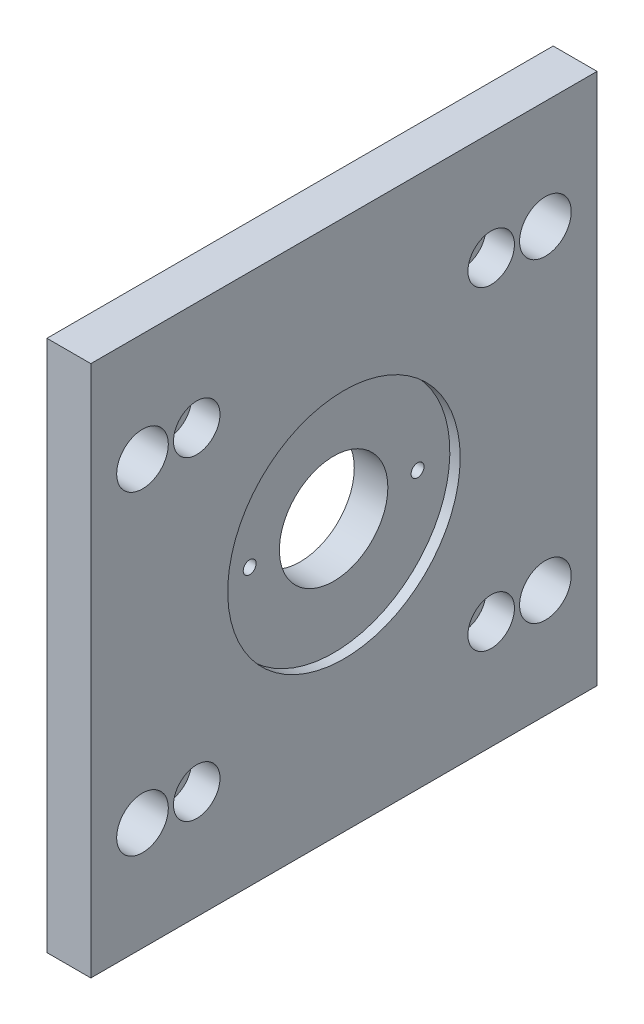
ISO-10303-21;
HEADER;
FILE_DESCRIPTION(('STEP AP214'),'2;1');
FILE_NAME('part.step','',(''),(''),'','','');
FILE_SCHEMA(('AUTOMOTIVE_DESIGN { 1 0 10303 214 1 1 1 1 }'));
ENDSEC;
DATA;
#1=APPLICATION_CONTEXT('core data for automotive mechanical design processes');
#2=APPLICATION_PROTOCOL_DEFINITION('international standard','automotive_design',2000,#1);
#3=PRODUCT_CONTEXT('',#1,'mechanical');
#4=PRODUCT('Part','Part','',(#3));
#5=PRODUCT_RELATED_PRODUCT_CATEGORY('part','',(#4));
#6=PRODUCT_DEFINITION_FORMATION('','',#4);
#7=PRODUCT_DEFINITION_CONTEXT('part definition',#1,'design');
#8=PRODUCT_DEFINITION('design','',#6,#7);
#9=PRODUCT_DEFINITION_SHAPE('','',#8);
#10=(LENGTH_UNIT() NAMED_UNIT(*) SI_UNIT(.MILLI.,.METRE.));
#11=(NAMED_UNIT(*) PLANE_ANGLE_UNIT() SI_UNIT($,.RADIAN.));
#12=(NAMED_UNIT(*) SI_UNIT($,.STERADIAN.) SOLID_ANGLE_UNIT());
#13=UNCERTAINTY_MEASURE_WITH_UNIT(LENGTH_MEASURE(1.E-05),#10,'distance_accuracy_value','');
#14=(GEOMETRIC_REPRESENTATION_CONTEXT(3) GLOBAL_UNCERTAINTY_ASSIGNED_CONTEXT((#13)) GLOBAL_UNIT_ASSIGNED_CONTEXT((#10,
#11,#12)) REPRESENTATION_CONTEXT('',''));
#15=CARTESIAN_POINT('',(0.,0.,0.));
#16=DIRECTION('',(0.,0.,1.));
#17=DIRECTION('',(1.,0.,0.));
#18=AXIS2_PLACEMENT_3D('',#15,#16,#17);
#19=CARTESIAN_POINT('',(-17.,78.0000000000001,98.0000000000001));
#20=DIRECTION('',(-1.,0.,0.));
#21=DIRECTION('',(0.,0.,1.));
#22=AXIS2_PLACEMENT_3D('',#19,#20,#21);
#23=PLANE('',#22);
#24=CARTESIAN_POINT('',(-17.,78.0000000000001,65.5000000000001));
#25=DIRECTION('',(1.,0.,0.));
#26=DIRECTION('',(0.,0.,-1.));
#27=AXIS2_PLACEMENT_3D('',#24,#25,#26);
#28=CIRCLE('',#27,2.5);
#29=CARTESIAN_POINT('',(-17.,78.0000000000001,63.0000000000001));
#30=VERTEX_POINT('',#29);
#31=EDGE_CURVE('E109',#30,#30,#28,.T.);
#32=ORIENTED_EDGE('',*,*,#31,.T.);
#33=EDGE_LOOP('',(#32));
#34=FACE_BOUND('',#33,.T.);
#35=CARTESIAN_POINT('',(-17.,78.0000000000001,98.0000000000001));
#36=DIRECTION('',(-1.,0.,0.));
#37=DIRECTION('',(0.,0.,1.));
#38=AXIS2_PLACEMENT_3D('',#35,#36,#37);
#39=CIRCLE('',#38,21.);
#40=CARTESIAN_POINT('',(-17.,78.0000000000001,119.));
#41=VERTEX_POINT('',#40);
#42=EDGE_CURVE('E118',#41,#41,#39,.T.);
#43=ORIENTED_EDGE('',*,*,#42,.F.);
#44=EDGE_LOOP('',(#43));
#45=FACE_BOUND('',#44,.T.);
#46=CARTESIAN_POINT('',(-17.,139.,155.));
#47=DIRECTION('',(-1.,0.,0.));
#48=DIRECTION('',(0.,0.,1.));
#49=AXIS2_PLACEMENT_3D('',#46,#47,#48);
#50=CIRCLE('',#49,5.5);
#51=CARTESIAN_POINT('',(-17.,139.,160.5));
#52=VERTEX_POINT('',#51);
#53=EDGE_CURVE('E33',#52,#52,#50,.T.);
#54=ORIENTED_EDGE('',*,*,#53,.F.);
#55=EDGE_LOOP('',(#54));
#56=FACE_BOUND('',#55,.T.);
#57=CARTESIAN_POINT('',(-17.,139.,41.));
#58=DIRECTION('',(-1.,0.,0.));
#59=DIRECTION('',(0.,0.,1.));
#60=AXIS2_PLACEMENT_3D('',#57,#58,#59);
#61=CIRCLE('',#60,5.5);
#62=CARTESIAN_POINT('',(-17.,139.,46.5));
#63=VERTEX_POINT('',#62);
#64=EDGE_CURVE('E142',#63,#63,#61,.T.);
#65=ORIENTED_EDGE('',*,*,#64,.F.);
#66=EDGE_LOOP('',(#65));
#67=FACE_BOUND('',#66,.T.);
#68=CARTESIAN_POINT('',(-17.,17.,155.));
#69=DIRECTION('',(-1.,0.,0.));
#70=DIRECTION('',(0.,0.,1.));
#71=AXIS2_PLACEMENT_3D('',#68,#69,#70);
#72=CIRCLE('',#71,5.5);
#73=CARTESIAN_POINT('',(-17.,17.,160.5));
#74=VERTEX_POINT('',#73);
#75=EDGE_CURVE('E150',#74,#74,#72,.T.);
#76=ORIENTED_EDGE('',*,*,#75,.F.);
#77=EDGE_LOOP('',(#76));
#78=FACE_BOUND('',#77,.T.);
#79=CARTESIAN_POINT('',(-17.,17.,41.));
#80=DIRECTION('',(-1.,0.,0.));
#81=DIRECTION('',(0.,0.,1.));
#82=AXIS2_PLACEMENT_3D('',#79,#80,#81);
#83=CIRCLE('',#82,5.5);
#84=CARTESIAN_POINT('',(-17.,17.,46.5));
#85=VERTEX_POINT('',#84);
#86=EDGE_CURVE('E182',#85,#85,#83,.T.);
#87=ORIENTED_EDGE('',*,*,#86,.F.);
#88=EDGE_LOOP('',(#87));
#89=FACE_BOUND('',#88,.T.);
#90=CARTESIAN_POINT('',(-17.,139.,176.));
#91=DIRECTION('',(-1.,0.,0.));
#92=DIRECTION('',(0.,0.,1.));
#93=AXIS2_PLACEMENT_3D('',#90,#91,#92);
#94=CIRCLE('',#93,10.);
#95=CARTESIAN_POINT('',(-17.,139.,186.));
#96=VERTEX_POINT('',#95);
#97=EDGE_CURVE('E151',#96,#96,#94,.T.);
#98=ORIENTED_EDGE('',*,*,#97,.F.);
#99=EDGE_LOOP('',(#98));
#100=FACE_BOUND('',#99,.T.);
#101=CARTESIAN_POINT('',(-17.,139.,20.));
#102=DIRECTION('',(-1.,0.,0.));
#103=DIRECTION('',(0.,0.,1.));
#104=AXIS2_PLACEMENT_3D('',#101,#102,#103);
#105=CIRCLE('',#104,10.);
#106=CARTESIAN_POINT('',(-17.,139.,30.));
#107=VERTEX_POINT('',#106);
#108=EDGE_CURVE('E156',#107,#107,#105,.T.);
#109=ORIENTED_EDGE('',*,*,#108,.F.);
#110=EDGE_LOOP('',(#109));
#111=FACE_BOUND('',#110,.T.);
#112=CARTESIAN_POINT('',(-17.,17.,176.));
#113=DIRECTION('',(-1.,0.,0.));
#114=DIRECTION('',(0.,0.,1.));
#115=AXIS2_PLACEMENT_3D('',#112,#113,#114);
#116=CIRCLE('',#115,10.);
#117=CARTESIAN_POINT('',(-17.,17.,186.));
#118=VERTEX_POINT('',#117);
#119=EDGE_CURVE('E160',#118,#118,#116,.T.);
#120=ORIENTED_EDGE('',*,*,#119,.F.);
#121=EDGE_LOOP('',(#120));
#122=FACE_BOUND('',#121,.T.);
#123=CARTESIAN_POINT('',(-17.,17.,20.));
#124=DIRECTION('',(-1.,0.,0.));
#125=DIRECTION('',(0.,0.,1.));
#126=AXIS2_PLACEMENT_3D('',#123,#124,#125);
#127=CIRCLE('',#126,10.);
#128=CARTESIAN_POINT('',(-17.,17.,30.));
#129=VERTEX_POINT('',#128);
#130=EDGE_CURVE('E164',#129,#129,#127,.T.);
#131=ORIENTED_EDGE('',*,*,#130,.F.);
#132=EDGE_LOOP('',(#131));
#133=FACE_BOUND('',#132,.T.);
#134=DIRECTION('',(0.,1.,0.));
#135=VECTOR('',#134,1.);
#136=CARTESIAN_POINT('',(-17.,78.0000000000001,0.));
#137=LINE('',#136,#135);
#138=CARTESIAN_POINT('',(-17.,-25.,0.));
#139=VERTEX_POINT('',#138);
#140=CARTESIAN_POINT('',(-17.,181.,0.));
#141=VERTEX_POINT('',#140);
#142=EDGE_CURVE('E11',#139,#141,#137,.T.);
#143=ORIENTED_EDGE('',*,*,#142,.F.);
#144=DIRECTION('',(0.,0.,-1.));
#145=VECTOR('',#144,1.);
#146=CARTESIAN_POINT('',(-17.,-25.,196.));
#147=LINE('',#146,#145);
#148=CARTESIAN_POINT('',(-17.,-25.,196.));
#149=VERTEX_POINT('',#148);
#150=EDGE_CURVE('E99',#149,#139,#147,.T.);
#151=ORIENTED_EDGE('',*,*,#150,.F.);
#152=DIRECTION('',(0.,-1.,0.));
#153=VECTOR('',#152,1.);
#154=CARTESIAN_POINT('',(-17.,78.0000000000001,196.));
#155=LINE('',#154,#153);
#156=CARTESIAN_POINT('',(-17.,181.,196.));
#157=VERTEX_POINT('',#156);
#158=EDGE_CURVE('E38',#157,#149,#155,.T.);
#159=ORIENTED_EDGE('',*,*,#158,.F.);
#160=DIRECTION('',(0.,0.,1.));
#161=VECTOR('',#160,1.);
#162=CARTESIAN_POINT('',(-17.,181.,0.));
#163=LINE('',#162,#161);
#164=EDGE_CURVE('E85',#141,#157,#163,.T.);
#165=ORIENTED_EDGE('',*,*,#164,.F.);
#166=EDGE_LOOP('',(#143,#151,#159,#165));
#167=FACE_BOUND('',#166,.T.);
#168=CARTESIAN_POINT('',(-17.,78.0000000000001,130.5));
#169=DIRECTION('',(1.,0.,0.));
#170=DIRECTION('',(0.,0.,-1.));
#171=AXIS2_PLACEMENT_3D('',#168,#169,#170);
#172=CIRCLE('',#171,2.5);
#173=CARTESIAN_POINT('',(-17.,78.0000000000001,128.));
#174=VERTEX_POINT('',#173);
#175=EDGE_CURVE('E103',#174,#174,#172,.T.);
#176=ORIENTED_EDGE('',*,*,#175,.T.);
#177=EDGE_LOOP('',(#176));
#178=FACE_BOUND('',#177,.T.);
#179=ADVANCED_FACE('F30',(#34,#45,#56,#67,#78,#89,#100,#111,#122,#133,#167,#178),#23,.T.);
#180=CARTESIAN_POINT('',(0.,78.0000000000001,0.));
#181=DIRECTION('',(0.,0.,-1.));
#182=DIRECTION('',(-1.,0.,0.));
#183=AXIS2_PLACEMENT_3D('',#180,#181,#182);
#184=PLANE('',#183);
#185=DIRECTION('',(0.,-1.,0.));
#186=VECTOR('',#185,1.);
#187=CARTESIAN_POINT('',(0.,78.0000000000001,0.));
#188=LINE('',#187,#186);
#189=CARTESIAN_POINT('',(0.,181.,0.));
#190=VERTEX_POINT('',#189);
#191=CARTESIAN_POINT('',(0.,-25.,0.));
#192=VERTEX_POINT('',#191);
#193=EDGE_CURVE('E46',#190,#192,#188,.T.);
#194=ORIENTED_EDGE('',*,*,#193,.T.);
#195=DIRECTION('',(1.,0.,0.));
#196=VECTOR('',#195,1.);
#197=CARTESIAN_POINT('',(-17.,-25.,0.));
#198=LINE('',#197,#196);
#199=EDGE_CURVE('E101',#139,#192,#198,.T.);
#200=ORIENTED_EDGE('',*,*,#199,.F.);
#201=ORIENTED_EDGE('',*,*,#142,.T.);
#202=DIRECTION('',(-1.,0.,0.));
#203=VECTOR('',#202,1.);
#204=CARTESIAN_POINT('',(0.,181.,0.));
#205=LINE('',#204,#203);
#206=EDGE_CURVE('E81',#190,#141,#205,.T.);
#207=ORIENTED_EDGE('',*,*,#206,.F.);
#208=EDGE_LOOP('',(#194,#200,#201,#207));
#209=FACE_BOUND('',#208,.T.);
#210=ADVANCED_FACE('F82',(#209),#184,.T.);
#211=CARTESIAN_POINT('',(0.,78.0000000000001,98.0000000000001));
#212=DIRECTION('',(1.,0.,0.));
#213=DIRECTION('',(0.,0.,-1.));
#214=AXIS2_PLACEMENT_3D('',#211,#212,#213);
#215=PLANE('',#214);
#216=CARTESIAN_POINT('',(0.,139.,155.));
#217=DIRECTION('',(1.,0.,0.));
#218=DIRECTION('',(0.,0.,-1.));
#219=AXIS2_PLACEMENT_3D('',#216,#217,#218);
#220=CIRCLE('',#219,9.);
#221=CARTESIAN_POINT('',(0.,139.,146.));
#222=VERTEX_POINT('',#221);
#223=EDGE_CURVE('E125',#222,#222,#220,.T.);
#224=ORIENTED_EDGE('',*,*,#223,.F.);
#225=EDGE_LOOP('',(#224));
#226=FACE_BOUND('',#225,.T.);
#227=CARTESIAN_POINT('',(0.,139.,41.));
#228=DIRECTION('',(1.,0.,0.));
#229=DIRECTION('',(0.,0.,-1.));
#230=AXIS2_PLACEMENT_3D('',#227,#228,#229);
#231=CIRCLE('',#230,9.);
#232=CARTESIAN_POINT('',(0.,139.,32.));
#233=VERTEX_POINT('',#232);
#234=EDGE_CURVE('E131',#233,#233,#231,.T.);
#235=ORIENTED_EDGE('',*,*,#234,.F.);
#236=EDGE_LOOP('',(#235));
#237=FACE_BOUND('',#236,.T.);
#238=CARTESIAN_POINT('',(0.,17.,155.));
#239=DIRECTION('',(1.,0.,0.));
#240=DIRECTION('',(0.,0.,-1.));
#241=AXIS2_PLACEMENT_3D('',#238,#239,#240);
#242=CIRCLE('',#241,9.);
#243=CARTESIAN_POINT('',(0.,17.,146.));
#244=VERTEX_POINT('',#243);
#245=EDGE_CURVE('E138',#244,#244,#242,.T.);
#246=ORIENTED_EDGE('',*,*,#245,.F.);
#247=EDGE_LOOP('',(#246));
#248=FACE_BOUND('',#247,.T.);
#249=CARTESIAN_POINT('',(0.,17.,41.));
#250=DIRECTION('',(1.,0.,0.));
#251=DIRECTION('',(0.,0.,-1.));
#252=AXIS2_PLACEMENT_3D('',#249,#250,#251);
#253=CIRCLE('',#252,9.);
#254=CARTESIAN_POINT('',(0.,17.,32.));
#255=VERTEX_POINT('',#254);
#256=EDGE_CURVE('E146',#255,#255,#253,.T.);
#257=ORIENTED_EDGE('',*,*,#256,.F.);
#258=EDGE_LOOP('',(#257));
#259=FACE_BOUND('',#258,.T.);
#260=CARTESIAN_POINT('',(0.,139.,176.));
#261=DIRECTION('',(1.,0.,0.));
#262=DIRECTION('',(0.,0.,-1.));
#263=AXIS2_PLACEMENT_3D('',#260,#261,#262);
#264=CIRCLE('',#263,10.);
#265=CARTESIAN_POINT('',(0.,139.,166.));
#266=VERTEX_POINT('',#265);
#267=EDGE_CURVE('E155',#266,#266,#264,.T.);
#268=ORIENTED_EDGE('',*,*,#267,.F.);
#269=EDGE_LOOP('',(#268));
#270=FACE_BOUND('',#269,.T.);
#271=CARTESIAN_POINT('',(0.,139.,20.));
#272=DIRECTION('',(1.,0.,0.));
#273=DIRECTION('',(0.,0.,-1.));
#274=AXIS2_PLACEMENT_3D('',#271,#272,#273);
#275=CIRCLE('',#274,10.);
#276=CARTESIAN_POINT('',(0.,139.,10.));
#277=VERTEX_POINT('',#276);
#278=EDGE_CURVE('E154',#277,#277,#275,.T.);
#279=ORIENTED_EDGE('',*,*,#278,.F.);
#280=EDGE_LOOP('',(#279));
#281=FACE_BOUND('',#280,.T.);
#282=CARTESIAN_POINT('',(0.,17.,176.));
#283=DIRECTION('',(1.,0.,0.));
#284=DIRECTION('',(0.,0.,-1.));
#285=AXIS2_PLACEMENT_3D('',#282,#283,#284);
#286=CIRCLE('',#285,10.);
#287=CARTESIAN_POINT('',(0.,17.,166.));
#288=VERTEX_POINT('',#287);
#289=EDGE_CURVE('E159',#288,#288,#286,.T.);
#290=ORIENTED_EDGE('',*,*,#289,.F.);
#291=EDGE_LOOP('',(#290));
#292=FACE_BOUND('',#291,.T.);
#293=CARTESIAN_POINT('',(0.,17.,20.));
#294=DIRECTION('',(1.,0.,0.));
#295=DIRECTION('',(0.,0.,-1.));
#296=AXIS2_PLACEMENT_3D('',#293,#294,#295);
#297=CIRCLE('',#296,10.);
#298=CARTESIAN_POINT('',(0.,17.,9.99999999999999));
#299=VERTEX_POINT('',#298);
#300=EDGE_CURVE('E163',#299,#299,#297,.T.);
#301=ORIENTED_EDGE('',*,*,#300,.F.);
#302=EDGE_LOOP('',(#301));
#303=FACE_BOUND('',#302,.T.);
#304=CARTESIAN_POINT('',(0.,78.0000000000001,98.0000000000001));
#305=DIRECTION('',(1.,0.,0.));
#306=DIRECTION('',(0.,0.,-1.));
#307=AXIS2_PLACEMENT_3D('',#304,#305,#306);
#308=CIRCLE('',#307,45.);
#309=CARTESIAN_POINT('',(0.,78.0000000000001,53.0000000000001));
#310=VERTEX_POINT('',#309);
#311=EDGE_CURVE('E78',#310,#310,#308,.T.);
#312=ORIENTED_EDGE('',*,*,#311,.F.);
#313=EDGE_LOOP('',(#312));
#314=FACE_BOUND('',#313,.T.);
#315=DIRECTION('',(0.,1.,0.));
#316=VECTOR('',#315,1.);
#317=CARTESIAN_POINT('',(0.,78.0000000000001,196.));
#318=LINE('',#317,#316);
#319=CARTESIAN_POINT('',(0.,-25.,196.));
#320=VERTEX_POINT('',#319);
#321=CARTESIAN_POINT('',(0.,181.,196.));
#322=VERTEX_POINT('',#321);
#323=EDGE_CURVE('E77',#320,#322,#318,.T.);
#324=ORIENTED_EDGE('',*,*,#323,.F.);
#325=DIRECTION('',(0.,0.,1.));
#326=VECTOR('',#325,1.);
#327=CARTESIAN_POINT('',(0.,-25.,0.));
#328=LINE('',#327,#326);
#329=EDGE_CURVE('E76',#192,#320,#328,.T.);
#330=ORIENTED_EDGE('',*,*,#329,.F.);
#331=ORIENTED_EDGE('',*,*,#193,.F.);
#332=DIRECTION('',(0.,0.,-1.));
#333=VECTOR('',#332,1.);
#334=CARTESIAN_POINT('',(0.,181.,196.));
#335=LINE('',#334,#333);
#336=EDGE_CURVE('E74',#322,#190,#335,.T.);
#337=ORIENTED_EDGE('',*,*,#336,.F.);
#338=EDGE_LOOP('',(#324,#330,#331,#337));
#339=FACE_BOUND('',#338,.T.);
#340=ADVANCED_FACE('F72',(#226,#237,#248,#259,#270,#281,#292,#303,#314,#339),#215,.T.);
#341=CARTESIAN_POINT('',(0.,78.0000000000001,196.));
#342=DIRECTION('',(0.,0.,1.));
#343=DIRECTION('',(1.,0.,0.));
#344=AXIS2_PLACEMENT_3D('',#341,#342,#343);
#345=PLANE('',#344);
#346=ORIENTED_EDGE('',*,*,#323,.T.);
#347=DIRECTION('',(1.,0.,0.));
#348=VECTOR('',#347,1.);
#349=CARTESIAN_POINT('',(-17.,181.,196.));
#350=LINE('',#349,#348);
#351=EDGE_CURVE('E90',#157,#322,#350,.T.);
#352=ORIENTED_EDGE('',*,*,#351,.F.);
#353=ORIENTED_EDGE('',*,*,#158,.T.);
#354=DIRECTION('',(-1.,0.,0.));
#355=VECTOR('',#354,1.);
#356=CARTESIAN_POINT('',(0.,-25.,196.));
#357=LINE('',#356,#355);
#358=EDGE_CURVE('E96',#320,#149,#357,.T.);
#359=ORIENTED_EDGE('',*,*,#358,.F.);
#360=EDGE_LOOP('',(#346,#352,#353,#359));
#361=FACE_BOUND('',#360,.T.);
#362=ADVANCED_FACE('F234',(#361),#345,.T.);
#363=CARTESIAN_POINT('',(-4.,78.0000000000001,98.0000000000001));
#364=DIRECTION('',(-1.,0.,0.));
#365=DIRECTION('',(0.,0.,1.));
#366=AXIS2_PLACEMENT_3D('',#363,#364,#365);
#367=PLANE('',#366);
#368=CARTESIAN_POINT('',(-4.,78.0000000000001,130.5));
#369=DIRECTION('',(1.,0.,0.));
#370=DIRECTION('',(0.,0.,-1.));
#371=AXIS2_PLACEMENT_3D('',#368,#369,#370);
#372=CIRCLE('',#371,2.49999999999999);
#373=CARTESIAN_POINT('',(-4.,78.0000000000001,128.));
#374=VERTEX_POINT('',#373);
#375=EDGE_CURVE('E106',#374,#374,#372,.T.);
#376=ORIENTED_EDGE('',*,*,#375,.F.);
#377=EDGE_LOOP('',(#376));
#378=FACE_BOUND('',#377,.T.);
#379=CARTESIAN_POINT('',(-3.99999999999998,78.0000000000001,65.5000000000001));
#380=DIRECTION('',(1.,0.,0.));
#381=DIRECTION('',(0.,0.,-1.));
#382=AXIS2_PLACEMENT_3D('',#379,#380,#381);
#383=CIRCLE('',#382,2.49999999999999);
#384=CARTESIAN_POINT('',(-3.99999999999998,78.0000000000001,63.0000000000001));
#385=VERTEX_POINT('',#384);
#386=EDGE_CURVE('E112',#385,#385,#383,.T.);
#387=ORIENTED_EDGE('',*,*,#386,.F.);
#388=EDGE_LOOP('',(#387));
#389=FACE_BOUND('',#388,.T.);
#390=CARTESIAN_POINT('',(-4.,78.0000000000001,98.0000000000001));
#391=DIRECTION('',(1.,0.,0.));
#392=DIRECTION('',(0.,0.,-1.));
#393=AXIS2_PLACEMENT_3D('',#390,#391,#392);
#394=CIRCLE('',#393,21.);
#395=CARTESIAN_POINT('',(-4.,78.0000000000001,77.0000000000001));
#396=VERTEX_POINT('',#395);
#397=EDGE_CURVE('E115',#396,#396,#394,.T.);
#398=ORIENTED_EDGE('',*,*,#397,.F.);
#399=EDGE_LOOP('',(#398));
#400=FACE_BOUND('',#399,.T.);
#401=CARTESIAN_POINT('',(-4.,78.0000000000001,98.0000000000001));
#402=DIRECTION('',(1.,0.,0.));
#403=DIRECTION('',(0.,1.,0.));
#404=AXIS2_PLACEMENT_3D('',#401,#402,#403);
#405=CIRCLE('',#404,45.);
#406=CARTESIAN_POINT('',(-4.,123.,98.0000000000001));
#407=VERTEX_POINT('',#406);
#408=EDGE_CURVE('E167',#407,#407,#405,.T.);
#409=ORIENTED_EDGE('',*,*,#408,.T.);
#410=EDGE_LOOP('',(#409));
#411=FACE_BOUND('',#410,.T.);
#412=ADVANCED_FACE('F230',(#378,#389,#400,#411),#367,.F.);
#413=CARTESIAN_POINT('',(1.,78.0000000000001,98.0000000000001));
#414=DIRECTION('',(-1.,0.,0.));
#415=DIRECTION('',(0.,1.,0.));
#416=AXIS2_PLACEMENT_3D('',#413,#414,#415);
#417=CYLINDRICAL_SURFACE('',#416,45.);
#418=ORIENTED_EDGE('',*,*,#311,.T.);
#419=EDGE_LOOP('',(#418));
#420=FACE_BOUND('',#419,.T.);
#421=ORIENTED_EDGE('',*,*,#408,.F.);
#422=EDGE_LOOP('',(#421));
#423=FACE_BOUND('',#422,.T.);
#424=ADVANCED_FACE('F233',(#420,#423),#417,.F.);
#425=CARTESIAN_POINT('',(3.00000000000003,17.,20.));
#426=DIRECTION('',(-1.,0.,0.));
#427=DIRECTION('',(0.,1.,0.));
#428=AXIS2_PLACEMENT_3D('',#425,#426,#427);
#429=CYLINDRICAL_SURFACE('',#428,10.);
#430=ORIENTED_EDGE('',*,*,#130,.T.);
#431=EDGE_LOOP('',(#430));
#432=FACE_BOUND('',#431,.T.);
#433=ORIENTED_EDGE('',*,*,#300,.T.);
#434=EDGE_LOOP('',(#433));
#435=FACE_BOUND('',#434,.T.);
#436=ADVANCED_FACE('F243',(#432,#435),#429,.F.);
#437=CARTESIAN_POINT('',(3.00000000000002,17.,176.));
#438=DIRECTION('',(-1.,0.,0.));
#439=DIRECTION('',(0.,1.,0.));
#440=AXIS2_PLACEMENT_3D('',#437,#438,#439);
#441=CYLINDRICAL_SURFACE('',#440,10.);
#442=ORIENTED_EDGE('',*,*,#119,.T.);
#443=EDGE_LOOP('',(#442));
#444=FACE_BOUND('',#443,.T.);
#445=ORIENTED_EDGE('',*,*,#289,.T.);
#446=EDGE_LOOP('',(#445));
#447=FACE_BOUND('',#446,.T.);
#448=ADVANCED_FACE('F249',(#444,#447),#441,.F.);
#449=CARTESIAN_POINT('',(3.,139.,20.));
#450=DIRECTION('',(-1.,0.,0.));
#451=DIRECTION('',(0.,1.,0.));
#452=AXIS2_PLACEMENT_3D('',#449,#450,#451);
#453=CYLINDRICAL_SURFACE('',#452,10.);
#454=ORIENTED_EDGE('',*,*,#108,.T.);
#455=EDGE_LOOP('',(#454));
#456=FACE_BOUND('',#455,.T.);
#457=ORIENTED_EDGE('',*,*,#278,.T.);
#458=EDGE_LOOP('',(#457));
#459=FACE_BOUND('',#458,.T.);
#460=ADVANCED_FACE('F295',(#456,#459),#453,.F.);
#461=CARTESIAN_POINT('',(3.,139.,176.));
#462=DIRECTION('',(-1.,0.,0.));
#463=DIRECTION('',(0.,1.,0.));
#464=AXIS2_PLACEMENT_3D('',#461,#462,#463);
#465=CYLINDRICAL_SURFACE('',#464,10.);
#466=ORIENTED_EDGE('',*,*,#97,.T.);
#467=EDGE_LOOP('',(#466));
#468=FACE_BOUND('',#467,.T.);
#469=ORIENTED_EDGE('',*,*,#267,.T.);
#470=EDGE_LOOP('',(#469));
#471=FACE_BOUND('',#470,.T.);
#472=ADVANCED_FACE('F306',(#468,#471),#465,.F.);
#473=CARTESIAN_POINT('',(-11.,17.,41.));
#474=DIRECTION('',(-1.,0.,0.));
#475=DIRECTION('',(0.,0.,1.));
#476=AXIS2_PLACEMENT_3D('',#473,#474,#475);
#477=PLANE('',#476);
#478=CARTESIAN_POINT('',(-11.,17.,41.));
#479=DIRECTION('',(-1.,0.,0.));
#480=DIRECTION('',(0.,0.,1.));
#481=AXIS2_PLACEMENT_3D('',#478,#479,#480);
#482=CIRCLE('',#481,5.5);
#483=CARTESIAN_POINT('',(-11.,17.,46.5));
#484=VERTEX_POINT('',#483);
#485=EDGE_CURVE('E143',#484,#484,#482,.T.);
#486=ORIENTED_EDGE('',*,*,#485,.T.);
#487=EDGE_LOOP('',(#486));
#488=FACE_BOUND('',#487,.T.);
#489=CARTESIAN_POINT('',(-11.,17.,41.));
#490=DIRECTION('',(1.,0.,0.));
#491=DIRECTION('',(0.,1.,0.));
#492=AXIS2_PLACEMENT_3D('',#489,#490,#491);
#493=CIRCLE('',#492,9.);
#494=CARTESIAN_POINT('',(-11.,26.,41.));
#495=VERTEX_POINT('',#494);
#496=EDGE_CURVE('E147',#495,#495,#493,.T.);
#497=ORIENTED_EDGE('',*,*,#496,.T.);
#498=EDGE_LOOP('',(#497));
#499=FACE_BOUND('',#498,.T.);
#500=ADVANCED_FACE('F316',(#488,#499),#477,.F.);
#501=CARTESIAN_POINT('',(1.00000000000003,17.,41.));
#502=DIRECTION('',(-1.,0.,0.));
#503=DIRECTION('',(0.,1.,0.));
#504=AXIS2_PLACEMENT_3D('',#501,#502,#503);
#505=CYLINDRICAL_SURFACE('',#504,9.);
#506=ORIENTED_EDGE('',*,*,#256,.T.);
#507=EDGE_LOOP('',(#506));
#508=FACE_BOUND('',#507,.T.);
#509=ORIENTED_EDGE('',*,*,#496,.F.);
#510=EDGE_LOOP('',(#509));
#511=FACE_BOUND('',#510,.T.);
#512=ADVANCED_FACE('F326',(#508,#511),#505,.F.);
#513=CARTESIAN_POINT('',(1.00000000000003,17.,41.));
#514=DIRECTION('',(-1.,0.,0.));
#515=DIRECTION('',(0.,1.,0.));
#516=AXIS2_PLACEMENT_3D('',#513,#514,#515);
#517=CYLINDRICAL_SURFACE('',#516,5.5);
#518=ORIENTED_EDGE('',*,*,#86,.T.);
#519=EDGE_LOOP('',(#518));
#520=FACE_BOUND('',#519,.T.);
#521=ORIENTED_EDGE('',*,*,#485,.F.);
#522=EDGE_LOOP('',(#521));
#523=FACE_BOUND('',#522,.T.);
#524=ADVANCED_FACE('F336',(#520,#523),#517,.F.);
#525=CARTESIAN_POINT('',(-11.,17.,155.));
#526=DIRECTION('',(-1.,0.,0.));
#527=DIRECTION('',(0.,0.,1.));
#528=AXIS2_PLACEMENT_3D('',#525,#526,#527);
#529=PLANE('',#528);
#530=CARTESIAN_POINT('',(-11.,17.,155.));
#531=DIRECTION('',(-1.,0.,0.));
#532=DIRECTION('',(0.,0.,1.));
#533=AXIS2_PLACEMENT_3D('',#530,#531,#532);
#534=CIRCLE('',#533,5.5);
#535=CARTESIAN_POINT('',(-11.,17.,160.5));
#536=VERTEX_POINT('',#535);
#537=EDGE_CURVE('E135',#536,#536,#534,.T.);
#538=ORIENTED_EDGE('',*,*,#537,.T.);
#539=EDGE_LOOP('',(#538));
#540=FACE_BOUND('',#539,.T.);
#541=CARTESIAN_POINT('',(-11.,17.,155.));
#542=DIRECTION('',(1.,0.,0.));
#543=DIRECTION('',(0.,1.,0.));
#544=AXIS2_PLACEMENT_3D('',#541,#542,#543);
#545=CIRCLE('',#544,9.);
#546=CARTESIAN_POINT('',(-11.,26.,155.));
#547=VERTEX_POINT('',#546);
#548=EDGE_CURVE('E139',#547,#547,#545,.T.);
#549=ORIENTED_EDGE('',*,*,#548,.T.);
#550=EDGE_LOOP('',(#549));
#551=FACE_BOUND('',#550,.T.);
#552=ADVANCED_FACE('F346',(#540,#551),#529,.F.);
#553=CARTESIAN_POINT('',(1.00000000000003,17.,155.));
#554=DIRECTION('',(-1.,0.,0.));
#555=DIRECTION('',(0.,1.,0.));
#556=AXIS2_PLACEMENT_3D('',#553,#554,#555);
#557=CYLINDRICAL_SURFACE('',#556,9.);
#558=ORIENTED_EDGE('',*,*,#245,.T.);
#559=EDGE_LOOP('',(#558));
#560=FACE_BOUND('',#559,.T.);
#561=ORIENTED_EDGE('',*,*,#548,.F.);
#562=EDGE_LOOP('',(#561));
#563=FACE_BOUND('',#562,.T.);
#564=ADVANCED_FACE('F356',(#560,#563),#557,.F.);
#565=CARTESIAN_POINT('',(1.00000000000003,17.,155.));
#566=DIRECTION('',(-1.,0.,0.));
#567=DIRECTION('',(0.,1.,0.));
#568=AXIS2_PLACEMENT_3D('',#565,#566,#567);
#569=CYLINDRICAL_SURFACE('',#568,5.5);
#570=ORIENTED_EDGE('',*,*,#75,.T.);
#571=EDGE_LOOP('',(#570));
#572=FACE_BOUND('',#571,.T.);
#573=ORIENTED_EDGE('',*,*,#537,.F.);
#574=EDGE_LOOP('',(#573));
#575=FACE_BOUND('',#574,.T.);
#576=ADVANCED_FACE('F366',(#572,#575),#569,.F.);
#577=CARTESIAN_POINT('',(-11.,139.,41.));
#578=DIRECTION('',(-1.,0.,0.));
#579=DIRECTION('',(0.,0.,1.));
#580=AXIS2_PLACEMENT_3D('',#577,#578,#579);
#581=PLANE('',#580);
#582=CARTESIAN_POINT('',(-11.,139.,41.));
#583=DIRECTION('',(-1.,0.,0.));
#584=DIRECTION('',(0.,0.,1.));
#585=AXIS2_PLACEMENT_3D('',#582,#583,#584);
#586=CIRCLE('',#585,5.5);
#587=CARTESIAN_POINT('',(-11.,139.,46.5));
#588=VERTEX_POINT('',#587);
#589=EDGE_CURVE('E128',#588,#588,#586,.T.);
#590=ORIENTED_EDGE('',*,*,#589,.T.);
#591=EDGE_LOOP('',(#590));
#592=FACE_BOUND('',#591,.T.);
#593=CARTESIAN_POINT('',(-11.,139.,41.));
#594=DIRECTION('',(1.,0.,0.));
#595=DIRECTION('',(0.,1.,0.));
#596=AXIS2_PLACEMENT_3D('',#593,#594,#595);
#597=CIRCLE('',#596,9.);
#598=CARTESIAN_POINT('',(-11.,148.,41.));
#599=VERTEX_POINT('',#598);
#600=EDGE_CURVE('E132',#599,#599,#597,.T.);
#601=ORIENTED_EDGE('',*,*,#600,.T.);
#602=EDGE_LOOP('',(#601));
#603=FACE_BOUND('',#602,.T.);
#604=ADVANCED_FACE('F376',(#592,#603),#581,.F.);
#605=CARTESIAN_POINT('',(1.,139.,41.));
#606=DIRECTION('',(-1.,0.,0.));
#607=DIRECTION('',(0.,1.,0.));
#608=AXIS2_PLACEMENT_3D('',#605,#606,#607);
#609=CYLINDRICAL_SURFACE('',#608,9.);
#610=ORIENTED_EDGE('',*,*,#234,.T.);
#611=EDGE_LOOP('',(#610));
#612=FACE_BOUND('',#611,.T.);
#613=ORIENTED_EDGE('',*,*,#600,.F.);
#614=EDGE_LOOP('',(#613));
#615=FACE_BOUND('',#614,.T.);
#616=ADVANCED_FACE('F386',(#612,#615),#609,.F.);
#617=CARTESIAN_POINT('',(1.,139.,41.));
#618=DIRECTION('',(-1.,0.,0.));
#619=DIRECTION('',(0.,1.,0.));
#620=AXIS2_PLACEMENT_3D('',#617,#618,#619);
#621=CYLINDRICAL_SURFACE('',#620,5.5);
#622=ORIENTED_EDGE('',*,*,#64,.T.);
#623=EDGE_LOOP('',(#622));
#624=FACE_BOUND('',#623,.T.);
#625=ORIENTED_EDGE('',*,*,#589,.F.);
#626=EDGE_LOOP('',(#625));
#627=FACE_BOUND('',#626,.T.);
#628=ADVANCED_FACE('F396',(#624,#627),#621,.F.);
#629=CARTESIAN_POINT('',(-11.,139.,155.));
#630=DIRECTION('',(-1.,0.,0.));
#631=DIRECTION('',(0.,0.,1.));
#632=AXIS2_PLACEMENT_3D('',#629,#630,#631);
#633=PLANE('',#632);
#634=CARTESIAN_POINT('',(-11.,139.,155.));
#635=DIRECTION('',(-1.,0.,0.));
#636=DIRECTION('',(0.,0.,1.));
#637=AXIS2_PLACEMENT_3D('',#634,#635,#636);
#638=CIRCLE('',#637,5.5);
#639=CARTESIAN_POINT('',(-11.,139.,160.5));
#640=VERTEX_POINT('',#639);
#641=EDGE_CURVE('E122',#640,#640,#638,.T.);
#642=ORIENTED_EDGE('',*,*,#641,.T.);
#643=EDGE_LOOP('',(#642));
#644=FACE_BOUND('',#643,.T.);
#645=CARTESIAN_POINT('',(-11.,139.,155.));
#646=DIRECTION('',(1.,0.,0.));
#647=DIRECTION('',(0.,1.,0.));
#648=AXIS2_PLACEMENT_3D('',#645,#646,#647);
#649=CIRCLE('',#648,9.);
#650=CARTESIAN_POINT('',(-11.,148.,155.));
#651=VERTEX_POINT('',#650);
#652=EDGE_CURVE('E121',#651,#651,#649,.T.);
#653=ORIENTED_EDGE('',*,*,#652,.T.);
#654=EDGE_LOOP('',(#653));
#655=FACE_BOUND('',#654,.T.);
#656=ADVANCED_FACE('F406',(#644,#655),#633,.F.);
#657=CARTESIAN_POINT('',(1.,139.,155.));
#658=DIRECTION('',(-1.,0.,0.));
#659=DIRECTION('',(0.,1.,0.));
#660=AXIS2_PLACEMENT_3D('',#657,#658,#659);
#661=CYLINDRICAL_SURFACE('',#660,9.);
#662=ORIENTED_EDGE('',*,*,#223,.T.);
#663=EDGE_LOOP('',(#662));
#664=FACE_BOUND('',#663,.T.);
#665=ORIENTED_EDGE('',*,*,#652,.F.);
#666=EDGE_LOOP('',(#665));
#667=FACE_BOUND('',#666,.T.);
#668=ADVANCED_FACE('F416',(#664,#667),#661,.F.);
#669=CARTESIAN_POINT('',(1.,139.,155.));
#670=DIRECTION('',(-1.,0.,0.));
#671=DIRECTION('',(0.,1.,0.));
#672=AXIS2_PLACEMENT_3D('',#669,#670,#671);
#673=CYLINDRICAL_SURFACE('',#672,5.5);
#674=ORIENTED_EDGE('',*,*,#53,.T.);
#675=EDGE_LOOP('',(#674));
#676=FACE_BOUND('',#675,.T.);
#677=ORIENTED_EDGE('',*,*,#641,.F.);
#678=EDGE_LOOP('',(#677));
#679=FACE_BOUND('',#678,.T.);
#680=ADVANCED_FACE('F200',(#676,#679),#673,.F.);
#681=CARTESIAN_POINT('',(-19.,78.0000000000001,98.0000000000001));
#682=DIRECTION('',(1.,0.,0.));
#683=DIRECTION('',(0.,0.,-1.));
#684=AXIS2_PLACEMENT_3D('',#681,#682,#683);
#685=CYLINDRICAL_SURFACE('',#684,21.);
#686=ORIENTED_EDGE('',*,*,#42,.T.);
#687=EDGE_LOOP('',(#686));
#688=FACE_BOUND('',#687,.T.);
#689=ORIENTED_EDGE('',*,*,#397,.T.);
#690=EDGE_LOOP('',(#689));
#691=FACE_BOUND('',#690,.T.);
#692=ADVANCED_FACE('F434',(#688,#691),#685,.F.);
#693=CARTESIAN_POINT('',(-3.99999999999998,78.0000000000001,65.5000000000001));
#694=DIRECTION('',(1.,0.,0.));
#695=DIRECTION('',(0.,0.,-1.));
#696=AXIS2_PLACEMENT_3D('',#693,#694,#695);
#697=CYLINDRICAL_SURFACE('',#696,2.5);
#698=ORIENTED_EDGE('',*,*,#31,.F.);
#699=EDGE_LOOP('',(#698));
#700=FACE_BOUND('',#699,.T.);
#701=ORIENTED_EDGE('',*,*,#386,.T.);
#702=EDGE_LOOP('',(#701));
#703=FACE_BOUND('',#702,.T.);
#704=ADVANCED_FACE('F226',(#700,#703),#697,.F.);
#705=CARTESIAN_POINT('',(-4.,78.0000000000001,130.5));
#706=DIRECTION('',(1.,0.,0.));
#707=DIRECTION('',(0.,0.,-1.));
#708=AXIS2_PLACEMENT_3D('',#705,#706,#707);
#709=CYLINDRICAL_SURFACE('',#708,2.5);
#710=ORIENTED_EDGE('',*,*,#175,.F.);
#711=EDGE_LOOP('',(#710));
#712=FACE_BOUND('',#711,.T.);
#713=ORIENTED_EDGE('',*,*,#375,.T.);
#714=EDGE_LOOP('',(#713));
#715=FACE_BOUND('',#714,.T.);
#716=ADVANCED_FACE('F222',(#712,#715),#709,.F.);
#717=CARTESIAN_POINT('',(0.,-25.,0.));
#718=DIRECTION('',(0.,1.,0.));
#719=DIRECTION('',(0.,0.,1.));
#720=AXIS2_PLACEMENT_3D('',#717,#718,#719);
#721=PLANE('',#720);
#722=ORIENTED_EDGE('',*,*,#329,.T.);
#723=ORIENTED_EDGE('',*,*,#358,.T.);
#724=ORIENTED_EDGE('',*,*,#150,.T.);
#725=ORIENTED_EDGE('',*,*,#199,.T.);
#726=EDGE_LOOP('',(#722,#723,#724,#725));
#727=FACE_BOUND('',#726,.T.);
#728=ADVANCED_FACE('F225',(#727),#721,.F.);
#729=CARTESIAN_POINT('',(0.,181.,0.));
#730=DIRECTION('',(0.,1.,0.));
#731=DIRECTION('',(0.,0.,1.));
#732=AXIS2_PLACEMENT_3D('',#729,#730,#731);
#733=PLANE('',#732);
#734=ORIENTED_EDGE('',*,*,#336,.T.);
#735=ORIENTED_EDGE('',*,*,#206,.T.);
#736=ORIENTED_EDGE('',*,*,#164,.T.);
#737=ORIENTED_EDGE('',*,*,#351,.T.);
#738=EDGE_LOOP('',(#734,#735,#736,#737));
#739=FACE_BOUND('',#738,.T.);
#740=ADVANCED_FACE('F88',(#739),#733,.T.);
#741=CLOSED_SHELL('',(#179,#210,#340,#362,#412,#424,#436,#448,#460,#472,#500,#512,#524,#552,
#564,#576,#604,#616,#628,#656,#668,#680,#692,#704,#716,#728,#740));
#742=MANIFOLD_SOLID_BREP('B2',#741);
#743=ADVANCED_BREP_SHAPE_REPRESENTATION('',(#18,#742),#14);
#744=SHAPE_DEFINITION_REPRESENTATION(#9,#743);
ENDSEC;
END-ISO-10303-21;
